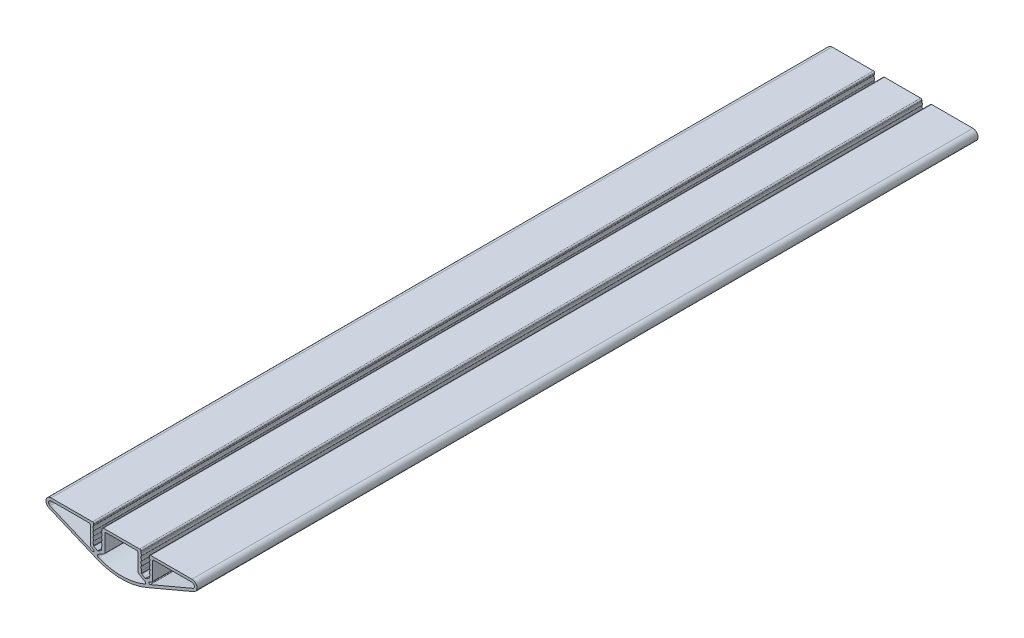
from build123d import *

# Parameters (mm, degrees)
EXTRUDE_1_DEPTH = 300


with BuildPart() as part:
    # Model → Extrude 1 (new body)
    with BuildSketch(Plane.XY):
        with BuildLine():
            Line((474.504802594, 2198.122958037), (458.651125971, 2198.122958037))
            ThreePointArc((458.651125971, 2198.122958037), (458.29757258, 2197.976511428), (458.151125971, 2197.622958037))
            Line((458.151125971, 2197.622958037), (458.151125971, 2197.322958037))
            ThreePointArc((458.151125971, 2197.322958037), (458.19332015, 2197.066578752), (458.315451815, 2196.837243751))
            ThreePointArc((458.315451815, 2196.837243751), (458.438696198, 2196.472958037), (458.315451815, 2196.108672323))
            ThreePointArc((458.315451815, 2196.108672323), (458.151125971, 2195.622958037), (458.315451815, 2195.137243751))
            ThreePointArc((458.315451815, 2195.137243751), (458.438696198, 2194.772958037), (458.315451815, 2194.408672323))
            ThreePointArc((458.315451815, 2194.408672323), (458.151125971, 2193.922958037), (458.315451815, 2193.437243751))
            ThreePointArc((458.315451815, 2193.437243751), (458.438696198, 2193.072958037), (458.315451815, 2192.708672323))
            ThreePointArc((458.315451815, 2192.708672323), (458.151125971, 2192.222958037), (458.315451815, 2191.737243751))
            ThreePointArc((458.315451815, 2191.737243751), (458.438696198, 2191.372958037), (458.315451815, 2191.008672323))
            ThreePointArc((458.315451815, 2191.008672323), (458.19332015, 2190.779337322), (458.151125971, 2190.522958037))
            Line((458.151125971, 2190.522958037), (458.151125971, 2190.404453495))
            ThreePointArc((458.151125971, 2190.404453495), (458.124331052, 2190.304453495), (458.051125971, 2190.231248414))
            Line((458.051125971, 2190.231248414), (456.651125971, 2189.422958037))
            Line((456.651125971, 2189.422958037), (455.201125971, 2190.260115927))
            ThreePointArc((455.201125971, 2190.260115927), (455.16452343, 2190.296718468), (455.151125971, 2190.346718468))
            Line((455.151125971, 2190.346718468), (455.151125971, 2191.372958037))
            ThreePointArc((455.151125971, 2191.372958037), (455.108931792, 2191.629337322), (454.986800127, 2191.858672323))
            ThreePointArc((454.986800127, 2191.858672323), (454.863555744, 2192.222958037), (454.986800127, 2192.587243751))
            ThreePointArc((454.986800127, 2192.587243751), (455.151125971, 2193.072958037), (454.986800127, 2193.558672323))
            ThreePointArc((454.986800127, 2193.558672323), (454.863555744, 2193.922958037), (454.986800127, 2194.287243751))
            ThreePointArc((454.986800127, 2194.287243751), (455.151125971, 2194.772958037), (454.986800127, 2195.258672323))
            ThreePointArc((454.986800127, 2195.258672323), (454.863555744, 2195.622958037), (454.986800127, 2195.987243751))
            ThreePointArc((454.986800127, 2195.987243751), (455.150849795, 2196.451938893), (455.011436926, 2196.924609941))
            ThreePointArc((455.011436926, 2196.924609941), (454.933459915, 2197.086063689), (454.906670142, 2197.26334887))
            Line((454.906670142, 2197.26334887), (454.906670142, 2197.622958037))
            ThreePointArc((454.906670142, 2197.622958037), (454.760223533, 2197.976511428), (454.406670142, 2198.122958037))
            Line((454.406670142, 2198.122958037), (440.534472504, 2198.122958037))
            ThreePointArc((440.534472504, 2198.122958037), (440.180919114, 2197.976511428), (440.034472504, 2197.622958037))
            Line((440.034472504, 2197.622958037), (440.034472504, 2197.26334887))
            ThreePointArc((440.034472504, 2197.26334887), (440.007682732, 2197.086063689), (439.929705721, 2196.924609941))
            ThreePointArc((439.929705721, 2196.924609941), (439.790292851, 2196.451938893), (439.95434252, 2195.987243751))
            ThreePointArc((439.95434252, 2195.987243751), (440.077586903, 2195.622958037), (439.95434252, 2195.258672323))
            ThreePointArc((439.95434252, 2195.258672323), (439.790016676, 2194.772958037), (439.95434252, 2194.287243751))
            ThreePointArc((439.95434252, 2194.287243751), (440.077586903, 2193.922958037), (439.95434252, 2193.558672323))
            ThreePointArc((439.95434252, 2193.558672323), (439.790016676, 2193.072958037), (439.95434252, 2192.587243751))
            ThreePointArc((439.95434252, 2192.587243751), (440.077586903, 2192.222958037), (439.95434252, 2191.858672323))
            ThreePointArc((439.95434252, 2191.858672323), (439.832210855, 2191.629337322), (439.790016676, 2191.372958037))
            Line((439.790016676, 2191.372958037), (439.790016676, 2190.346718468))
            ThreePointArc((439.790016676, 2190.346718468), (439.776619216, 2190.296718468), (439.740016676, 2190.260115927))
            Line((439.740016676, 2190.260115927), (438.290016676, 2189.422958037))
            Line((438.290016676, 2189.422958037), (436.890016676, 2190.231248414))
            ThreePointArc((436.890016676, 2190.231248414), (436.816811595, 2190.304453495), (436.790016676, 2190.404453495))
            Line((436.790016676, 2190.404453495), (436.790016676, 2190.522958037))
            ThreePointArc((436.790016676, 2190.522958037), (436.747822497, 2190.779337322), (436.625690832, 2191.008672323))
            ThreePointArc((436.625690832, 2191.008672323), (436.502446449, 2191.372958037), (436.625690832, 2191.737243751))
            ThreePointArc((436.625690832, 2191.737243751), (436.790016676, 2192.222958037), (436.625690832, 2192.708672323))
            ThreePointArc((436.625690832, 2192.708672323), (436.502446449, 2193.072958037), (436.625690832, 2193.437243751))
            ThreePointArc((436.625690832, 2193.437243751), (436.790016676, 2193.922958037), (436.625690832, 2194.408672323))
            ThreePointArc((436.625690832, 2194.408672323), (436.502446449, 2194.772958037), (436.625690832, 2195.137243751))
            ThreePointArc((436.625690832, 2195.137243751), (436.790016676, 2195.622958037), (436.625690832, 2196.108672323))
            ThreePointArc((436.625690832, 2196.108672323), (436.502446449, 2196.472958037), (436.625690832, 2196.837243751))
            ThreePointArc((436.625690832, 2196.837243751), (436.747822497, 2197.066578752), (436.790016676, 2197.322958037))
            Line((436.790016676, 2197.322958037), (436.790016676, 2197.622958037))
            ThreePointArc((436.790016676, 2197.622958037), (436.643570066, 2197.976511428), (436.290016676, 2198.122958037))
            Line((436.290016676, 2198.122958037), (420.436340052, 2198.122958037))
            ThreePointArc((420.436340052, 2198.122958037), (418.509925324, 2196.548562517), (419.669263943, 2194.347260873))
            Line((419.669263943, 2194.347260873), (437.917702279, 2186.613285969))
            ThreePointArc((437.917702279, 2186.613285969), (447.470571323, 2184.672511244), (457.023440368, 2186.613285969))
            Line((457.023440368, 2186.613285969), (475.271878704, 2194.347260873))
            ThreePointArc((475.271878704, 2194.347260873), (476.431217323, 2196.548562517), (474.504802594, 2198.122958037))
        make_face()
        with BuildLine():
            Line((453.863555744, 2189.993131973), (453.863555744, 2196.622958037))
            ThreePointArc((453.863555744, 2196.622958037), (453.717109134, 2196.976511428), (453.363555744, 2197.122958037))
            Line((453.363555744, 2197.122958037), (441.577586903, 2197.122958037))
            ThreePointArc((441.577586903, 2197.122958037), (441.224033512, 2196.976511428), (441.077586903, 2196.622958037))
            Line((441.077586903, 2196.622958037), (441.077586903, 2189.993131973))
            ThreePointArc((441.077586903, 2189.993131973), (441.050791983, 2189.893131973), (440.977586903, 2189.819926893))
            Line((440.977586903, 2189.819926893), (438.434234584, 2188.351521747))
            ThreePointArc((438.434234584, 2188.351521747), (438.185311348, 2187.885712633), (438.493068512, 2187.456496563))
            ThreePointArc((438.493068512, 2187.456496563), (447.470571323, 2185.672534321), (456.448074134, 2187.456496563))
            ThreePointArc((456.448074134, 2187.456496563), (456.755831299, 2187.885712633), (456.506908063, 2188.351521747))
            Line((456.506908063, 2188.351521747), (453.963555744, 2189.819926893))
            ThreePointArc((453.963555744, 2189.819926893), (453.890350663, 2189.893131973), (453.863555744, 2189.993131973))
        make_face(mode=Mode.SUBTRACT)
        with BuildLine():
            Line((436.694375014, 2189.083131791), (435.67472366, 2189.562892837))
            ThreePointArc((435.67472366, 2189.562892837), (435.549151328, 2189.673592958), (435.502446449, 2189.834346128))
            Line((435.502446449, 2189.834346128), (435.502446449, 2196.622958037))
            ThreePointArc((435.502446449, 2196.622958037), (435.355999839, 2196.976511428), (435.002446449, 2197.122958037))
            Line((435.002446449, 2197.122958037), (420.436340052, 2197.122958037))
            ThreePointArc((420.436340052, 2197.122958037), (419.489905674, 2196.349468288), (420.059480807, 2195.267983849))
            Line((420.059480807, 2195.267983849), (436.437544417, 2188.330666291))
            ThreePointArc((436.437544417, 2188.330666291), (436.902634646, 2188.591985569), (436.694375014, 2189.083131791))
        make_face(mode=Mode.SUBTRACT)
        with BuildLine():
            Line((458.523215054, 2188.335017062), (474.881661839, 2195.267983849))
            ThreePointArc((474.881661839, 2195.267983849), (475.451236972, 2196.349468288), (474.504802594, 2197.122958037))
            Line((474.504802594, 2197.122958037), (459.938696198, 2197.122958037))
            ThreePointArc((459.938696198, 2197.122958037), (459.585142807, 2196.976511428), (459.438696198, 2196.622958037))
            Line((459.438696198, 2196.622958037), (459.438696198, 2189.834346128))
            ThreePointArc((459.438696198, 2189.834346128), (459.391991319, 2189.673592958), (459.266418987, 2189.562892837))
            Line((459.266418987, 2189.562892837), (458.246767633, 2189.083131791))
            ThreePointArc((458.246767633, 2189.083131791), (458.038508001, 2188.591985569), (458.503598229, 2188.330666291))
            Line((458.503598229, 2188.330666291), (458.523215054, 2188.335017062))
        make_face(mode=Mode.SUBTRACT)
    extrude(amount=EXTRUDE_1_DEPTH)


solid = part.part
